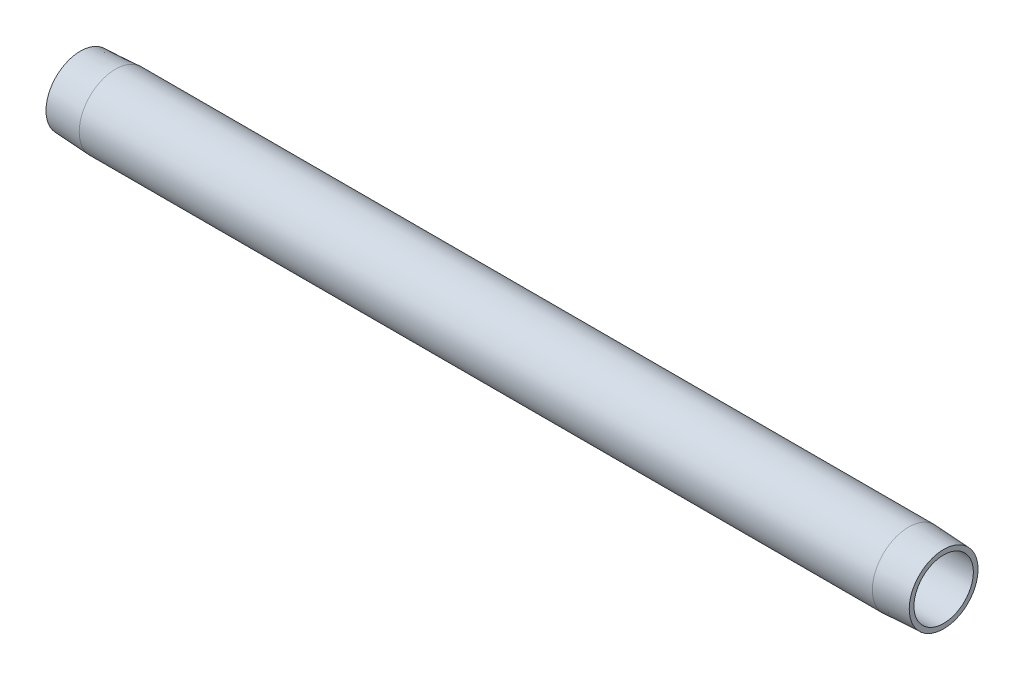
ISO-10303-21;
HEADER;
FILE_DESCRIPTION(('STEP AP214'),'2;1');
FILE_NAME('part.step','',(''),(''),'','','');
FILE_SCHEMA(('AUTOMOTIVE_DESIGN { 1 0 10303 214 1 1 1 1 }'));
ENDSEC;
DATA;
#1=APPLICATION_CONTEXT('core data for automotive mechanical design processes');
#2=APPLICATION_PROTOCOL_DEFINITION('international standard','automotive_design',2000,#1);
#3=PRODUCT_CONTEXT('',#1,'mechanical');
#4=PRODUCT('Part','Part','',(#3));
#5=PRODUCT_RELATED_PRODUCT_CATEGORY('part','',(#4));
#6=PRODUCT_DEFINITION_FORMATION('','',#4);
#7=PRODUCT_DEFINITION_CONTEXT('part definition',#1,'design');
#8=PRODUCT_DEFINITION('design','',#6,#7);
#9=PRODUCT_DEFINITION_SHAPE('','',#8);
#10=(LENGTH_UNIT() NAMED_UNIT(*) SI_UNIT(.MILLI.,.METRE.));
#11=(NAMED_UNIT(*) PLANE_ANGLE_UNIT() SI_UNIT($,.RADIAN.));
#12=(NAMED_UNIT(*) SI_UNIT($,.STERADIAN.) SOLID_ANGLE_UNIT());
#13=UNCERTAINTY_MEASURE_WITH_UNIT(LENGTH_MEASURE(1.E-05),#10,'distance_accuracy_value','');
#14=(GEOMETRIC_REPRESENTATION_CONTEXT(3) GLOBAL_UNCERTAINTY_ASSIGNED_CONTEXT((#13)) GLOBAL_UNIT_ASSIGNED_CONTEXT((#10,
#11,#12)) REPRESENTATION_CONTEXT('',''));
#15=CARTESIAN_POINT('',(0.,0.,0.));
#16=DIRECTION('',(0.,0.,1.));
#17=DIRECTION('',(1.,0.,0.));
#18=AXIS2_PLACEMENT_3D('',#15,#16,#17);
#19=CARTESIAN_POINT('',(254.,8.73125,0.));
#20=DIRECTION('',(-1.,0.,0.));
#21=DIRECTION('',(0.,0.,1.));
#22=AXIS2_PLACEMENT_3D('',#19,#20,#21);
#23=PLANE('',#22);
#24=CARTESIAN_POINT('',(254.,0.,0.));
#25=DIRECTION('',(-1.,0.,0.));
#26=DIRECTION('',(0.,0.,1.));
#27=AXIS2_PLACEMENT_3D('',#24,#25,#26);
#28=CIRCLE('',#27,10.1275500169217);
#29=CARTESIAN_POINT('',(254.,0.,10.1275500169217));
#30=VERTEX_POINT('',#29);
#31=EDGE_CURVE('E10',#30,#30,#28,.T.);
#32=ORIENTED_EDGE('',*,*,#31,.F.);
#33=EDGE_LOOP('',(#32));
#34=FACE_BOUND('',#33,.T.);
#35=CARTESIAN_POINT('',(254.,0.,0.));
#36=DIRECTION('',(-1.,0.,0.));
#37=DIRECTION('',(0.,0.,1.));
#38=AXIS2_PLACEMENT_3D('',#35,#36,#37);
#39=CIRCLE('',#38,8.73125);
#40=CARTESIAN_POINT('',(254.,0.,8.73125));
#41=VERTEX_POINT('',#40);
#42=EDGE_CURVE('E52',#41,#41,#39,.T.);
#43=ORIENTED_EDGE('',*,*,#42,.T.);
#44=EDGE_LOOP('',(#43));
#45=FACE_BOUND('',#44,.T.);
#46=ADVANCED_FACE('F30',(#34,#45),#23,.F.);
#47=CARTESIAN_POINT('',(254.,0.,0.));
#48=DIRECTION('',(-1.,0.,0.));
#49=DIRECTION('',(0.,0.,1.));
#50=AXIS2_PLACEMENT_3D('',#47,#48,#49);
#51=CONICAL_SURFACE('',#50,10.1275500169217,0.0523598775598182);
#52=CARTESIAN_POINT('',(243.6876,0.,0.));
#53=DIRECTION('',(-1.,0.,0.));
#54=DIRECTION('',(0.,0.,1.));
#55=AXIS2_PLACEMENT_3D('',#52,#53,#54);
#56=CIRCLE('',#55,10.668);
#57=CARTESIAN_POINT('',(243.6876,0.,10.668));
#58=VERTEX_POINT('',#57);
#59=EDGE_CURVE('E36',#58,#58,#56,.T.);
#60=ORIENTED_EDGE('',*,*,#59,.F.);
#61=EDGE_LOOP('',(#60));
#62=FACE_BOUND('',#61,.T.);
#63=ORIENTED_EDGE('',*,*,#31,.T.);
#64=EDGE_LOOP('',(#63));
#65=FACE_BOUND('',#64,.T.);
#66=ADVANCED_FACE('F77',(#62,#65),#51,.T.);
#67=CARTESIAN_POINT('',(0.,0.,0.));
#68=DIRECTION('',(-1.,0.,0.));
#69=DIRECTION('',(0.,0.,1.));
#70=AXIS2_PLACEMENT_3D('',#67,#68,#69);
#71=CYLINDRICAL_SURFACE('',#70,10.668);
#72=CARTESIAN_POINT('',(10.3124,0.,0.));
#73=DIRECTION('',(-1.,0.,0.));
#74=DIRECTION('',(0.,0.,1.));
#75=AXIS2_PLACEMENT_3D('',#72,#73,#74);
#76=CIRCLE('',#75,10.668);
#77=CARTESIAN_POINT('',(10.3124,0.,10.668));
#78=VERTEX_POINT('',#77);
#79=EDGE_CURVE('E40',#78,#78,#76,.T.);
#80=ORIENTED_EDGE('',*,*,#79,.F.);
#81=EDGE_LOOP('',(#80));
#82=FACE_BOUND('',#81,.T.);
#83=ORIENTED_EDGE('',*,*,#59,.T.);
#84=EDGE_LOOP('',(#83));
#85=FACE_BOUND('',#84,.T.);
#86=ADVANCED_FACE('F72',(#82,#85),#71,.T.);
#87=CARTESIAN_POINT('',(10.3124,0.,0.));
#88=DIRECTION('',(1.,0.,0.));
#89=DIRECTION('',(0.,0.,-1.));
#90=AXIS2_PLACEMENT_3D('',#87,#88,#89);
#91=CONICAL_SURFACE('',#90,10.668,0.0523598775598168);
#92=CARTESIAN_POINT('',(0.,0.,0.));
#93=DIRECTION('',(-1.,0.,0.));
#94=DIRECTION('',(0.,0.,1.));
#95=AXIS2_PLACEMENT_3D('',#92,#93,#94);
#96=CIRCLE('',#95,10.1275500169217);
#97=CARTESIAN_POINT('',(0.,0.,10.1275500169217));
#98=VERTEX_POINT('',#97);
#99=EDGE_CURVE('E44',#98,#98,#96,.T.);
#100=ORIENTED_EDGE('',*,*,#99,.F.);
#101=EDGE_LOOP('',(#100));
#102=FACE_BOUND('',#101,.T.);
#103=ORIENTED_EDGE('',*,*,#79,.T.);
#104=EDGE_LOOP('',(#103));
#105=FACE_BOUND('',#104,.T.);
#106=ADVANCED_FACE('F66',(#102,#105),#91,.T.);
#107=CARTESIAN_POINT('',(0.,10.1275500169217,0.));
#108=DIRECTION('',(1.,0.,0.));
#109=DIRECTION('',(0.,0.,-1.));
#110=AXIS2_PLACEMENT_3D('',#107,#108,#109);
#111=PLANE('',#110);
#112=CARTESIAN_POINT('',(0.,0.,0.));
#113=DIRECTION('',(-1.,0.,0.));
#114=DIRECTION('',(0.,0.,1.));
#115=AXIS2_PLACEMENT_3D('',#112,#113,#114);
#116=CIRCLE('',#115,8.73125);
#117=CARTESIAN_POINT('',(0.,0.,8.73125));
#118=VERTEX_POINT('',#117);
#119=EDGE_CURVE('E49',#118,#118,#116,.T.);
#120=ORIENTED_EDGE('',*,*,#119,.F.);
#121=EDGE_LOOP('',(#120));
#122=FACE_BOUND('',#121,.T.);
#123=ORIENTED_EDGE('',*,*,#99,.T.);
#124=EDGE_LOOP('',(#123));
#125=FACE_BOUND('',#124,.T.);
#126=ADVANCED_FACE('F60',(#122,#125),#111,.F.);
#127=CARTESIAN_POINT('',(0.,0.,0.));
#128=DIRECTION('',(-1.,0.,0.));
#129=DIRECTION('',(0.,0.,1.));
#130=AXIS2_PLACEMENT_3D('',#127,#128,#129);
#131=CYLINDRICAL_SURFACE('',#130,8.73125);
#132=ORIENTED_EDGE('',*,*,#42,.F.);
#133=EDGE_LOOP('',(#132));
#134=FACE_BOUND('',#133,.T.);
#135=ORIENTED_EDGE('',*,*,#119,.T.);
#136=EDGE_LOOP('',(#135));
#137=FACE_BOUND('',#136,.T.);
#138=ADVANCED_FACE('F57',(#134,#137),#131,.F.);
#139=CLOSED_SHELL('',(#46,#66,#86,#106,#126,#138));
#140=MANIFOLD_SOLID_BREP('B2',#139);
#141=ADVANCED_BREP_SHAPE_REPRESENTATION('',(#18,#140),#14);
#142=SHAPE_DEFINITION_REPRESENTATION(#9,#141);
ENDSEC;
END-ISO-10303-21;
